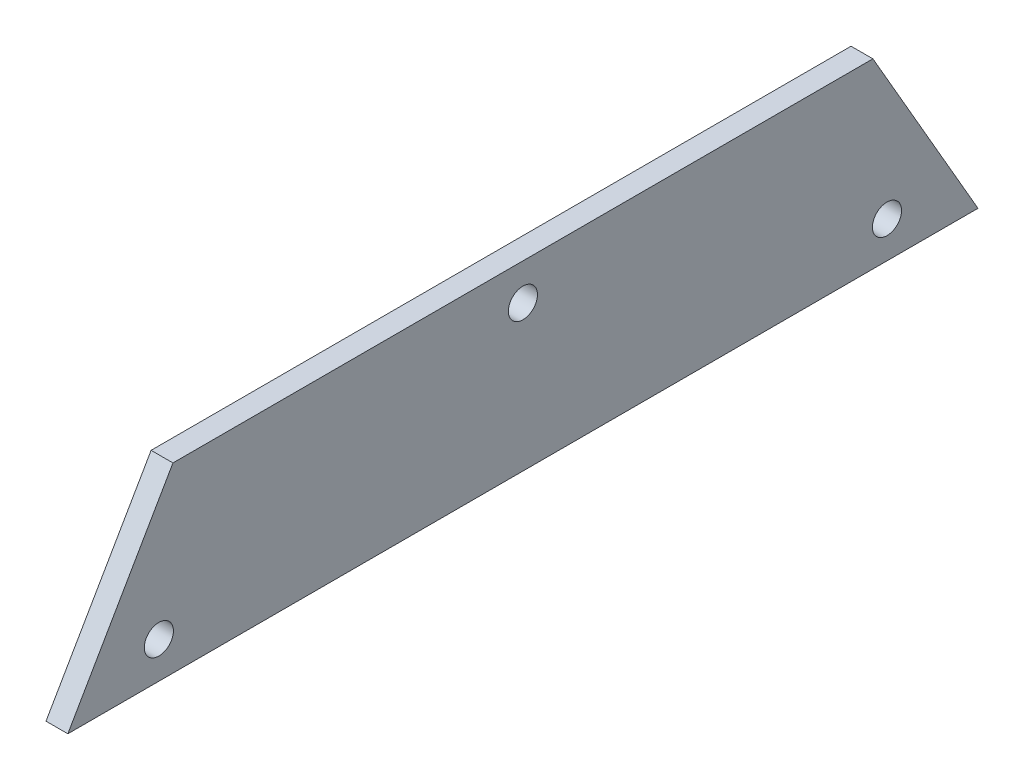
from build123d import *

# Parameters (mm, degrees)
SKETCH1_W          = 300
SKETCH1_H          = 50
SKETCH1_R          = 4
EXTRUDE1_DEPTH     = 6
CUT_EXTRUDE1_REACH = 154.187


with BuildPart() as part:
    # Sketch1 → Extrude1 (new body)
    with BuildSketch(Plane(origin=(0, 0, 0), x_dir=(0, 0, -1), z_dir=(1, 0, 0))):
        Rectangle(SKETCH1_W, SKETCH1_H)
        with Locations((0, 15)):
            Circle(SKETCH1_R, mode=Mode.SUBTRACT)
        with Locations((-100, -15)):
            Circle(SKETCH1_R, mode=Mode.SUBTRACT)
        with Locations(Location((100, -15, 0), (0, 0, 180))):
            Circle(SKETCH1_R, mode=Mode.SUBTRACT)
    extrude(amount=EXTRUDE1_DEPTH)

    # Sketch2 → Cut-Extrude1 (cut, up to next)
    with BuildSketch(Plane(origin=(6, 0, 0), x_dir=(0, 0, -1), z_dir=(1, 0, 0)), mode=Mode.PRIVATE) as cut_extrude1_sk1:
        Polygon((-150, 25), (-150, -25), (-125, -25), (-96.132486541, 25), align=None)
    cut_extrude1_tool1 = extrude(cut_extrude1_sk1.sketch, amount=-CUT_EXTRUDE1_REACH, mode=Mode.PRIVATE) & part.part
    # Sketch2 → Cut-Extrude1 (cut, up to next)
    with BuildSketch(Plane(origin=(6, 0, 0), x_dir=(0, 0, -1), z_dir=(1, 0, 0)), mode=Mode.PRIVATE) as cut_extrude1_sk2:
        Polygon((96.132486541, 25), (150, 25), (150, -25), (125, -25), align=None)
    cut_extrude1_tool2 = extrude(cut_extrude1_sk2.sketch, amount=-CUT_EXTRUDE1_REACH, mode=Mode.PRIVATE) & part.part
    add(cut_extrude1_tool1.solids().sort_by_distance((6, 3.050212, 129.402601))[0], mode=Mode.SUBTRACT)
    add(cut_extrude1_tool2.solids().sort_by_distance((6, 3.050212, -129.402601))[0], mode=Mode.SUBTRACT)


solid = part.part
